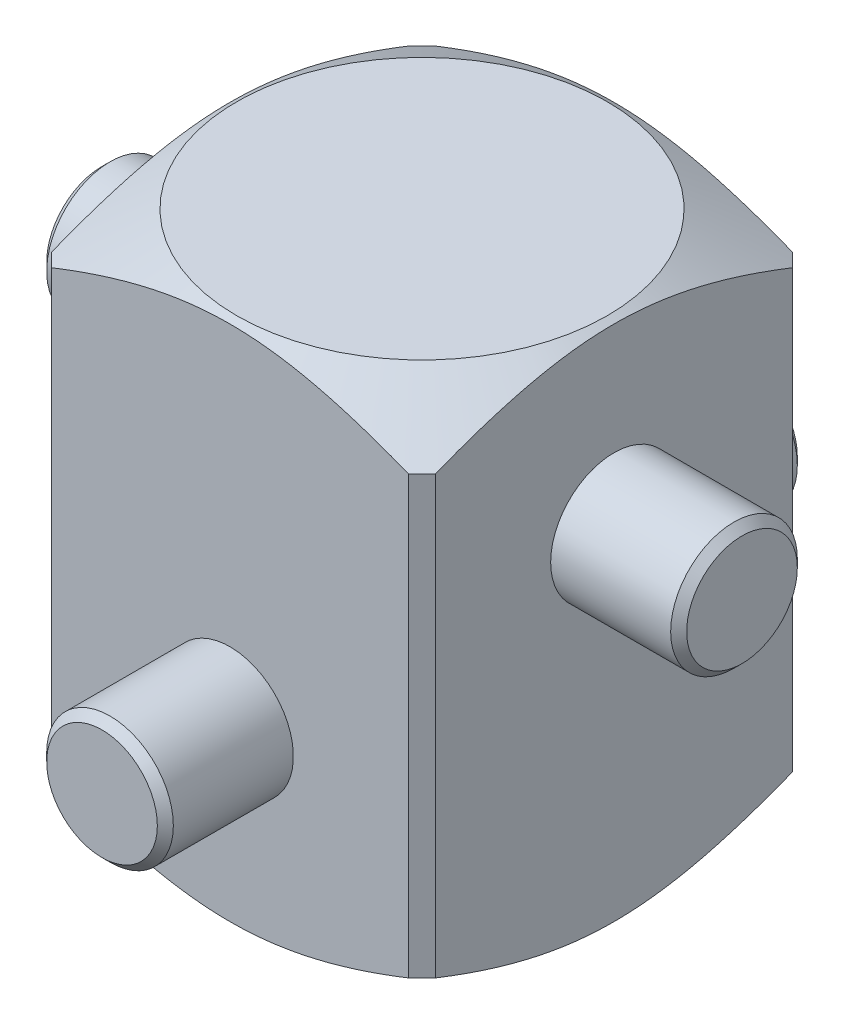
from build123d import *

# Parameters (mm, degrees)
SKETCH1_W           = 14.4
SKETCH1_H           = 14.4
BOSS_EXTRUDE1_DEPTH = 19.7
SKETCH3_R           = 2.375
BOSS_EXTRUDE2_DEPTH = 12
SKETCH4_R           = 2.375
BOSS_EXTRUDE3_DEPTH = 12
CHAMFER1_SIZE       = 0.3
CHAMFER2_SIZE       = 0.5


with BuildPart() as part:
    # Sketch1 → Boss-Extrude1 (new body)
    with BuildSketch(Plane(origin=(0, 0, 0), x_dir=(1, 0, 0), z_dir=(0, 1, 0))):
        Rectangle(SKETCH1_W, SKETCH1_H)
    extrude(amount=BOSS_EXTRUDE1_DEPTH)

    # Sketch2 → Cut-Revolve1 (revolve, cut)
    with BuildSketch(Plane.XY, mode=Mode.PRIVATE) as cut_revolve1_sk:
        Polygon((-6.95, 19.7), (-16.09, 19.7), (-16.09, 0), (-6.95, 0), (-13.55, 3.810511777), (-13.55, 15.889488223), align=None)
    revolve(cut_revolve1_sk.sketch.rotate(Axis((0, 20.685, 0), (0, -1, 0)), 270), axis=Axis((0, 20.685, 0), (0, -1, 0)), mode=Mode.SUBTRACT)

    # Sketch3 → Boss-Extrude2 (add, symmetric)
    with BuildSketch(Plane.XY):
        with Locations(Location((0, 6.7, 0), (0, 0, 180))):
            Circle(SKETCH3_R)
    extrude(amount=BOSS_EXTRUDE2_DEPTH, both=True)

    # Sketch4 → Boss-Extrude3 (add, symmetric)
    with BuildSketch(Plane(origin=(0, 0, 0), x_dir=(0, 0, -1), z_dir=(1, 0, 0))):
        with Locations((0, 13)):
            Circle(SKETCH4_R)
    extrude(amount=BOSS_EXTRUDE3_DEPTH, both=True)

    # Chamfer1
    chamfer1_edges = [part.edges().sort_by_distance(p)[0] for p in [
        (2.375, 6.7, -12),
        (2.375, 6.7, 12),
        (-12, 13, 2.375),
        (12, 13, 2.375),
    ]]
    chamfer(chamfer1_edges, length=CHAMFER1_SIZE)

    # Chamfer2
    chamfer2_edges = [part.edges().sort_by_distance(p)[0] for p in [
        (7.2, 9.85, 7.2),
        (7.2, 9.85, -7.2),
        (-7.2, 9.85, 7.2),
        (-7.2, 9.85, -7.2),
    ]]
    chamfer(chamfer2_edges, length=CHAMFER2_SIZE)


solid = part.part
